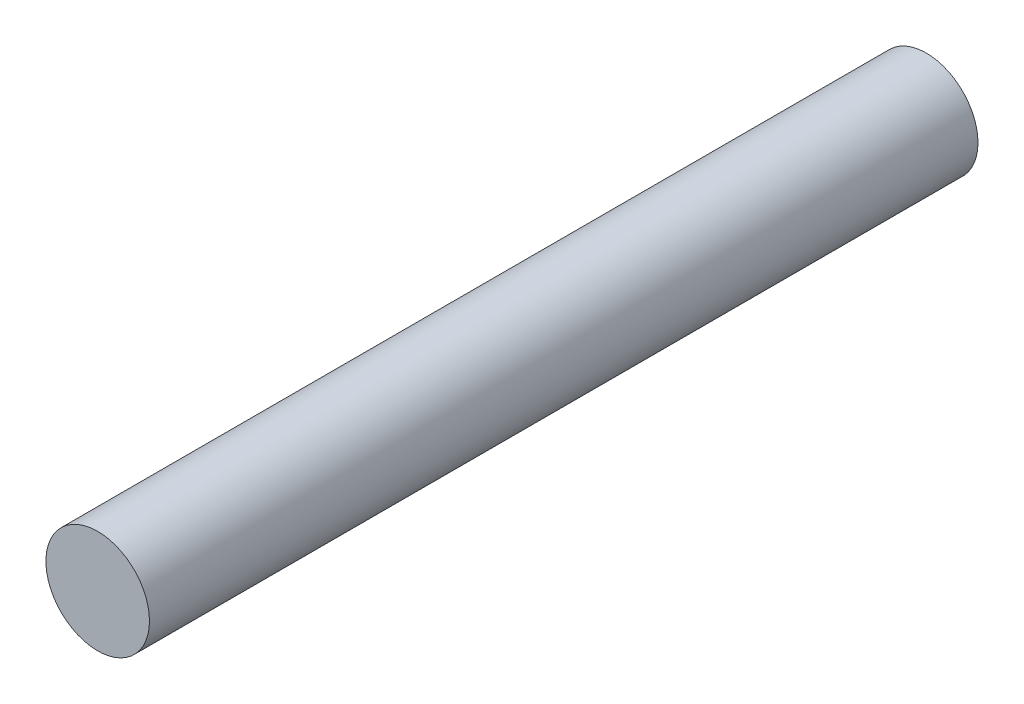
from build123d import *

# Parameters (mm, degrees)
SKIZZE1_R               = 5
LINEAR_AUSTRAGEN1_DEPTH = 80


with BuildPart() as part:
    # Skizze1 → Linear austragen1 (new body)
    with BuildSketch(Plane.XY):
        with Locations((-24.792828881, 17.563096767)):
            Circle(SKIZZE1_R)
    extrude(amount=LINEAR_AUSTRAGEN1_DEPTH)


solid = part.part
